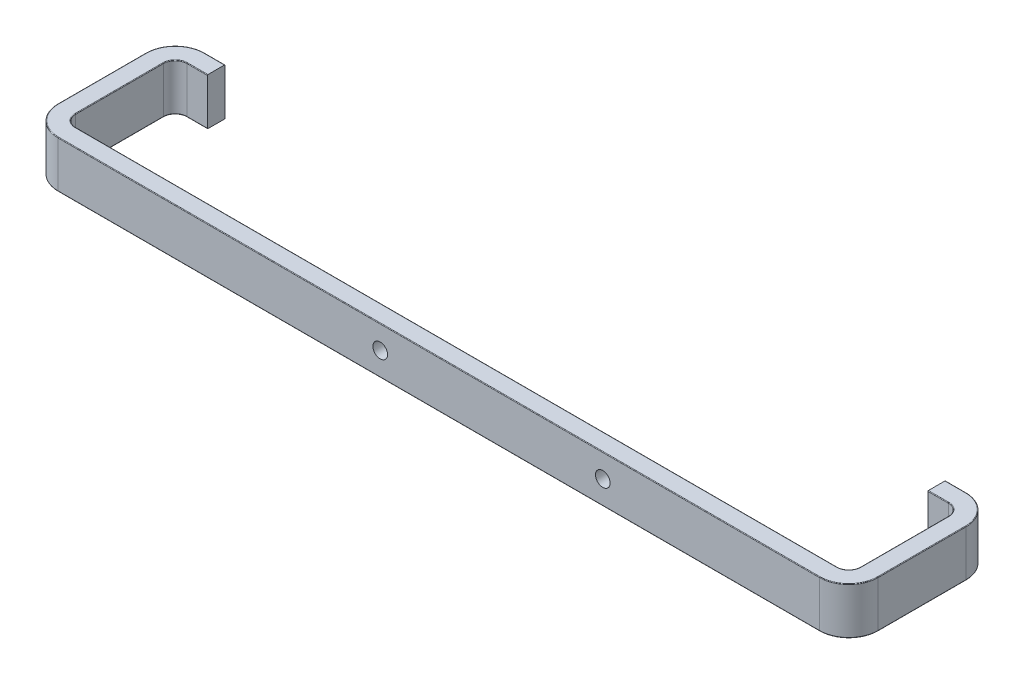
from build123d import *

# Parameters (mm, degrees)
ESQUISSE1_W                           = 700
ESQUISSE1_H                           = 125
BOSS_EXTRU_1_DEPTH                    = 40
ENL_V_MAT_EXTRU_1_DEPTH               = 374.798073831
DIAM_TRE_DU_PER_AGE_12_5_12_5_1_D     = 12.5
DIAM_TRE_DU_PER_AGE_12_5_12_5_1_DEPTH = 125
CONG_1_R                              = 10
CONG_2_R                              = 25
CONG_3_R                              = 0.5


with BuildPart() as part:
    # Esquisse1 → Boss.-Extru.1 (new body)
    with BuildSketch(Plane.XZ.offset(20)):
        with Locations((0, -62.5)):
            Rectangle(ESQUISSE1_W, ESQUISSE1_H)
    extrude(amount=-BOSS_EXTRU_1_DEPTH)

    # Esquisse2 → Enl_v. mat.-Extru.1 (cut, through all)
    with BuildSketch(Plane(origin=(0, 20, 0), x_dir=(-1, 0, 0), z_dir=(0, 1, 0))):
        Polygon((-307.5, -125), (307.5, -125), (307.5, -110), (335, -110), (335, -15), (-335, -15), (-335, -110), (-307.5, -110), align=None)
    extrude(amount=-ENL_V_MAT_EXTRU_1_DEPTH, mode=Mode.SUBTRACT)

    # Diam_tre du per_age _12.5 _12.5_1
    with Locations(Plane.XY):
        with Locations((140, 0), (-50, 0)):
            Hole(DIAM_TRE_DU_PER_AGE_12_5_12_5_1_D / 2, depth=DIAM_TRE_DU_PER_AGE_12_5_12_5_1_DEPTH)

    # Cong_1
    cong_1_edges = [part.edges().sort_by_distance(p)[0] for p in [
        (335, 0, -110),
        (335, 0, -15),
        (-335, 0, -15),
        (-335, 0, -110),
    ]]
    fillet(cong_1_edges, radius=CONG_1_R)

    # Cong_2
    cong_2_edges = [part.edges().sort_by_distance(p)[0] for p in [
        (-350, 0, 0),
        (350, 0, 0),
        (350, 0, -125),
        (-350, 0, -125),
    ]]
    fillet(cong_2_edges, radius=CONG_2_R)

    # Cong_3
    cong_3_edges = [part.edges().sort_by_distance(p)[0] for p in [
        (316.25, -20, -125),
        (316.25, 20, -125),
        (-316.25, -20, -110),
        (-316.25, 20, -110),
        (335, 20, -62.5),
        (335, -20, -62.5),
        (0, 20, -15),
        (0, -20, -15),
        (316.25, 20, -110),
        (316.25, -20, -110),
        (-335, 20, -62.5),
        (-335, -20, -62.5),
        (332.071067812, 20, -17.928932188),
        (332.071067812, -20, -17.928932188),
        (332.071067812, 20, -107.071067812),
        (332.071067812, -20, -107.071067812),
        (-332.071067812, 20, -107.071067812),
        (-332.071067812, -20, -107.071067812),
        (-332.071067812, 20, -17.928932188),
        (-332.071067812, -20, -17.928932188),
        (350, -20, -62.5),
        (350, 20, -62.5),
        (0, -20, 0),
        (-350, -20, -62.5),
        (-316.25, -20, -125),
        (-342.67766953, -20, -117.67766953),
        (342.67766953, -20, -117.67766953),
        (-342.67766953, -20, -7.32233047),
        (342.67766953, -20, -7.32233047),
        (0, 20, 0),
        (-316.25, 20, -125),
        (-350, 20, -62.5),
        (-342.67766953, 20, -117.67766953),
        (342.67766953, 20, -117.67766953),
        (-342.67766953, 20, -7.32233047),
        (342.67766953, 20, -7.32233047),
    ]]
    fillet(cong_3_edges, radius=CONG_3_R)


solid = part.part
